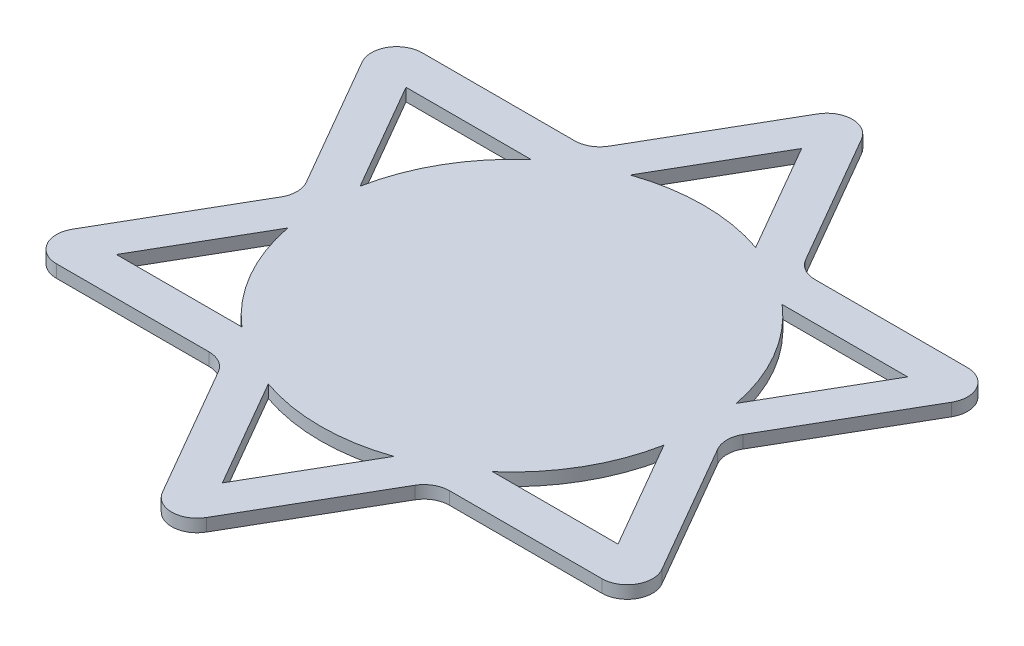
from build123d import *

# Parameters (mm, degrees)
EXTRUDE1_DEPTH = 1


with BuildPart() as part:
    # Sketch1 → Extrude1 (new body)
    with BuildSketch(Plane(origin=(0, 0, 0), x_dir=(1, 0, 0), z_dir=(0, 1, 0))):
        with BuildLine():
            Line((64.633538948, -43.653972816), (70.657471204, -54.087729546))
            ThreePointArc((70.657471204, -54.087729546), (71.389522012, -54.819780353), (72.389522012, -55.087729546))
            Line((72.389522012, -55.087729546), (84.437386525, -55.087729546))
            ThreePointArc((84.437386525, -55.087729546), (86.169437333, -56.087729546), (86.169437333, -58.087729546))
            Line((86.169437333, -58.087729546), (80.145505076, -68.521486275))
            ThreePointArc((80.145505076, -68.521486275), (79.877555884, -69.521486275), (80.145505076, -70.521486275))
            Line((80.145505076, -70.521486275), (86.169437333, -80.955243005))
            ThreePointArc((86.169437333, -80.955243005), (86.169437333, -82.955243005), (84.437386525, -83.955243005))
            Line((84.437386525, -83.955243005), (72.389522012, -83.955243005))
            ThreePointArc((72.389522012, -83.955243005), (71.389522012, -84.223192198), (70.657471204, -84.955243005))
            Line((70.657471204, -84.955243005), (64.633538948, -95.388999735))
            ThreePointArc((64.633538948, -95.388999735), (62.90148814, -96.388999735), (61.169437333, -95.388999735))
            Line((61.169437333, -95.388999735), (55.145505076, -84.955243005))
            ThreePointArc((55.145505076, -84.955243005), (54.413454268, -84.223192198), (53.413454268, -83.955243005))
            Line((53.413454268, -83.955243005), (41.365589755, -83.955243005))
            ThreePointArc((41.365589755, -83.955243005), (39.633538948, -82.955243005), (39.633538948, -80.955243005))
            Line((39.633538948, -80.955243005), (45.657471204, -70.521486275))
            ThreePointArc((45.657471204, -70.521486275), (45.925420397, -69.521486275), (45.657471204, -68.521486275))
            Line((45.657471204, -68.521486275), (39.633538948, -58.087729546))
            ThreePointArc((39.633538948, -58.087729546), (39.633538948, -56.087729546), (41.365589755, -55.087729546))
            Line((41.365589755, -55.087729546), (53.413454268, -55.087729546))
            ThreePointArc((53.413454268, -55.087729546), (54.413454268, -54.819780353), (55.145505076, -54.087729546))
            Line((55.145505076, -54.087729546), (61.169437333, -43.653972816))
            ThreePointArc((61.169437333, -43.653972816), (62.90148814, -42.653972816), (64.633538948, -43.653972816))
        make_face()
        with BuildLine():
            Line((48.051188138, -72.375446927), (43.097640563, -80.955243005))
            Line((43.097640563, -80.955243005), (53.004735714, -80.955243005))
            ThreePointArc((53.004735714, -80.955243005), (49.805405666, -77.082513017), (48.051188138, -72.375446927))
        make_face(mode=Mode.SUBTRACT)
        with BuildLine():
            Line((57.947940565, -83.809203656), (62.90148814, -92.388999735))
            Line((62.90148814, -92.388999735), (67.855035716, -83.809203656))
            ThreePointArc((67.855035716, -83.809203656), (62.90148814, -84.643539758), (57.947940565, -83.809203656))
        make_face(mode=Mode.SUBTRACT)
        with BuildLine():
            Line((72.798240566, -80.955243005), (82.705335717, -80.955243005))
            Line((82.705335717, -80.955243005), (77.751788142, -72.375446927))
            ThreePointArc((77.751788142, -72.375446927), (75.997570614, -77.082513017), (72.798240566, -80.955243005))
        make_face(mode=Mode.SUBTRACT)
        with BuildLine():
            Line((82.705335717, -58.087729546), (77.751788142, -66.667525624))
            ThreePointArc((77.751788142, -66.667525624), (75.997570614, -61.960459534), (72.798240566, -58.087729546))
            Line((72.798240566, -58.087729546), (82.705335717, -58.087729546))
        make_face(mode=Mode.SUBTRACT)
        with BuildLine():
            Line((62.90148814, -46.653972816), (67.855035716, -55.233768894))
            ThreePointArc((67.855035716, -55.233768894), (62.90148814, -54.399432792), (57.947940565, -55.233768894))
            Line((57.947940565, -55.233768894), (62.90148814, -46.653972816))
        make_face(mode=Mode.SUBTRACT)
        with BuildLine():
            Line((43.097640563, -58.087729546), (53.004735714, -58.087729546))
            ThreePointArc((53.004735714, -58.087729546), (49.805405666, -61.960459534), (48.051188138, -66.667525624))
            Line((48.051188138, -66.667525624), (43.097640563, -58.087729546))
        make_face(mode=Mode.SUBTRACT)
    extrude(amount=EXTRUDE1_DEPTH)


solid = part.part
